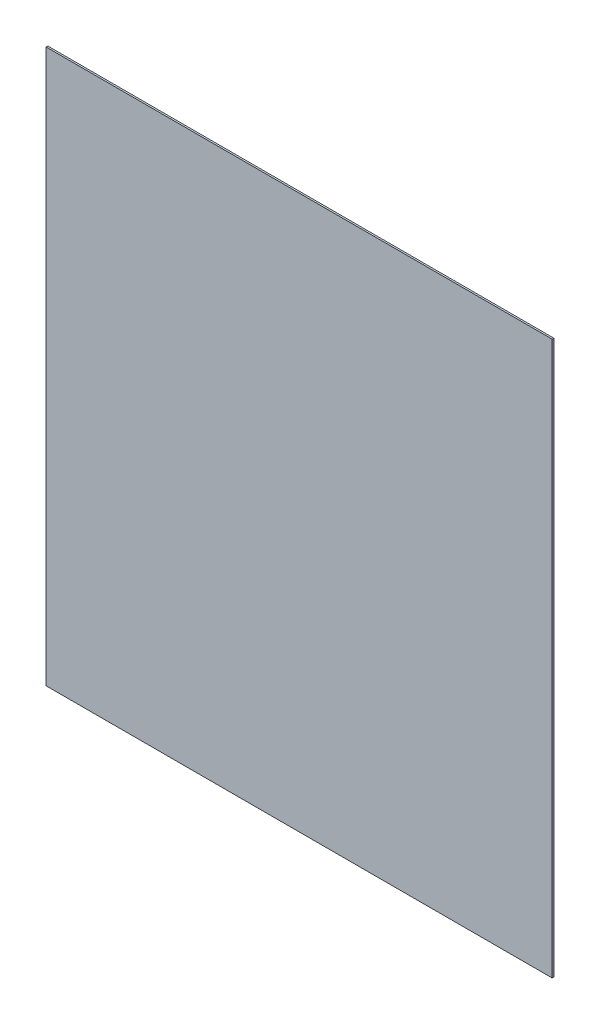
ISO-10303-21;
HEADER;
FILE_DESCRIPTION(('STEP AP214'),'2;1');
FILE_NAME('part.step','',(''),(''),'','','');
FILE_SCHEMA(('AUTOMOTIVE_DESIGN { 1 0 10303 214 1 1 1 1 }'));
ENDSEC;
DATA;
#1=APPLICATION_CONTEXT('core data for automotive mechanical design processes');
#2=APPLICATION_PROTOCOL_DEFINITION('international standard','automotive_design',2000,#1);
#3=PRODUCT_CONTEXT('',#1,'mechanical');
#4=PRODUCT('Part','Part','',(#3));
#5=PRODUCT_RELATED_PRODUCT_CATEGORY('part','',(#4));
#6=PRODUCT_DEFINITION_FORMATION('','',#4);
#7=PRODUCT_DEFINITION_CONTEXT('part definition',#1,'design');
#8=PRODUCT_DEFINITION('design','',#6,#7);
#9=PRODUCT_DEFINITION_SHAPE('','',#8);
#10=(LENGTH_UNIT() NAMED_UNIT(*) SI_UNIT(.MILLI.,.METRE.));
#11=(NAMED_UNIT(*) PLANE_ANGLE_UNIT() SI_UNIT($,.RADIAN.));
#12=(NAMED_UNIT(*) SI_UNIT($,.STERADIAN.) SOLID_ANGLE_UNIT());
#13=UNCERTAINTY_MEASURE_WITH_UNIT(LENGTH_MEASURE(1.E-05),#10,'distance_accuracy_value','');
#14=(GEOMETRIC_REPRESENTATION_CONTEXT(3) GLOBAL_UNCERTAINTY_ASSIGNED_CONTEXT((#13)) GLOBAL_UNIT_ASSIGNED_CONTEXT((#10,
#11,#12)) REPRESENTATION_CONTEXT('',''));
#15=CARTESIAN_POINT('',(0.,0.,0.));
#16=DIRECTION('',(0.,0.,1.));
#17=DIRECTION('',(1.,0.,0.));
#18=AXIS2_PLACEMENT_3D('',#15,#16,#17);
#19=CARTESIAN_POINT('',(0.,0.,2.));
#20=DIRECTION('',(0.,0.,1.));
#21=DIRECTION('',(1.,0.,0.));
#22=AXIS2_PLACEMENT_3D('',#19,#20,#21);
#23=PLANE('',#22);
#24=DIRECTION('',(1.,0.,0.));
#25=VECTOR('',#24,1.);
#26=CARTESIAN_POINT('',(-295.,-322.5,2.));
#27=LINE('',#26,#25);
#28=CARTESIAN_POINT('',(-295.,-322.5,2.));
#29=VERTEX_POINT('',#28);
#30=CARTESIAN_POINT('',(295.,-322.5,2.));
#31=VERTEX_POINT('',#30);
#32=EDGE_CURVE('E81',#29,#31,#27,.T.);
#33=ORIENTED_EDGE('',*,*,#32,.T.);
#34=DIRECTION('',(0.,1.,0.));
#35=VECTOR('',#34,1.);
#36=CARTESIAN_POINT('',(295.,-322.5,2.));
#37=LINE('',#36,#35);
#38=CARTESIAN_POINT('',(295.,322.5,2.));
#39=VERTEX_POINT('',#38);
#40=EDGE_CURVE('E96',#31,#39,#37,.T.);
#41=ORIENTED_EDGE('',*,*,#40,.T.);
#42=DIRECTION('',(-1.,0.,0.));
#43=VECTOR('',#42,1.);
#44=CARTESIAN_POINT('',(295.,322.5,2.));
#45=LINE('',#44,#43);
#46=CARTESIAN_POINT('',(-295.,322.5,2.));
#47=VERTEX_POINT('',#46);
#48=EDGE_CURVE('E74',#39,#47,#45,.T.);
#49=ORIENTED_EDGE('',*,*,#48,.T.);
#50=DIRECTION('',(0.,-1.,0.));
#51=VECTOR('',#50,1.);
#52=CARTESIAN_POINT('',(-295.,322.5,2.));
#53=LINE('',#52,#51);
#54=EDGE_CURVE('E10',#47,#29,#53,.T.);
#55=ORIENTED_EDGE('',*,*,#54,.T.);
#56=EDGE_LOOP('',(#33,#41,#49,#55));
#57=FACE_BOUND('',#56,.T.);
#58=ADVANCED_FACE('F16',(#57),#23,.T.);
#59=CARTESIAN_POINT('',(0.,0.,0.));
#60=DIRECTION('',(0.,0.,1.));
#61=DIRECTION('',(1.,0.,0.));
#62=AXIS2_PLACEMENT_3D('',#59,#60,#61);
#63=PLANE('',#62);
#64=DIRECTION('',(0.,-1.,0.));
#65=VECTOR('',#64,1.);
#66=CARTESIAN_POINT('',(-295.,322.5,0.));
#67=LINE('',#66,#65);
#68=CARTESIAN_POINT('',(-295.,322.5,0.));
#69=VERTEX_POINT('',#68);
#70=CARTESIAN_POINT('',(-295.,-322.5,0.));
#71=VERTEX_POINT('',#70);
#72=EDGE_CURVE('E25',#69,#71,#67,.T.);
#73=ORIENTED_EDGE('',*,*,#72,.F.);
#74=DIRECTION('',(-1.,0.,0.));
#75=VECTOR('',#74,1.);
#76=CARTESIAN_POINT('',(295.,322.5,0.));
#77=LINE('',#76,#75);
#78=CARTESIAN_POINT('',(295.,322.5,0.));
#79=VERTEX_POINT('',#78);
#80=EDGE_CURVE('E95',#79,#69,#77,.T.);
#81=ORIENTED_EDGE('',*,*,#80,.F.);
#82=DIRECTION('',(0.,1.,0.));
#83=VECTOR('',#82,1.);
#84=CARTESIAN_POINT('',(295.,-322.5,0.));
#85=LINE('',#84,#83);
#86=CARTESIAN_POINT('',(295.,-322.5,0.));
#87=VERTEX_POINT('',#86);
#88=EDGE_CURVE('E83',#87,#79,#85,.T.);
#89=ORIENTED_EDGE('',*,*,#88,.F.);
#90=DIRECTION('',(1.,0.,0.));
#91=VECTOR('',#90,1.);
#92=CARTESIAN_POINT('',(-295.,-322.5,0.));
#93=LINE('',#92,#91);
#94=EDGE_CURVE('E79',#71,#87,#93,.T.);
#95=ORIENTED_EDGE('',*,*,#94,.F.);
#96=EDGE_LOOP('',(#73,#81,#89,#95));
#97=FACE_BOUND('',#96,.T.);
#98=ADVANCED_FACE('F18',(#97),#63,.F.);
#99=CARTESIAN_POINT('',(-295.,322.5,0.));
#100=DIRECTION('',(1.,0.,0.));
#101=DIRECTION('',(0.,1.,0.));
#102=AXIS2_PLACEMENT_3D('',#99,#100,#101);
#103=PLANE('',#102);
#104=ORIENTED_EDGE('',*,*,#72,.T.);
#105=DIRECTION('',(0.,0.,1.));
#106=VECTOR('',#105,1.);
#107=CARTESIAN_POINT('',(-295.,-322.5,0.));
#108=LINE('',#107,#106);
#109=EDGE_CURVE('E68',#71,#29,#108,.T.);
#110=ORIENTED_EDGE('',*,*,#109,.T.);
#111=ORIENTED_EDGE('',*,*,#54,.F.);
#112=DIRECTION('',(0.,0.,1.));
#113=VECTOR('',#112,1.);
#114=CARTESIAN_POINT('',(-295.,322.5,0.));
#115=LINE('',#114,#113);
#116=EDGE_CURVE('E71',#69,#47,#115,.T.);
#117=ORIENTED_EDGE('',*,*,#116,.F.);
#118=EDGE_LOOP('',(#104,#110,#111,#117));
#119=FACE_BOUND('',#118,.T.);
#120=ADVANCED_FACE('F67',(#119),#103,.F.);
#121=CARTESIAN_POINT('',(295.,322.5,0.));
#122=DIRECTION('',(0.,-1.,0.));
#123=DIRECTION('',(0.,0.,-1.));
#124=AXIS2_PLACEMENT_3D('',#121,#122,#123);
#125=PLANE('',#124);
#126=ORIENTED_EDGE('',*,*,#80,.T.);
#127=ORIENTED_EDGE('',*,*,#116,.T.);
#128=ORIENTED_EDGE('',*,*,#48,.F.);
#129=DIRECTION('',(0.,0.,1.));
#130=VECTOR('',#129,1.);
#131=CARTESIAN_POINT('',(295.,322.5,0.));
#132=LINE('',#131,#130);
#133=EDGE_CURVE('E102',#79,#39,#132,.T.);
#134=ORIENTED_EDGE('',*,*,#133,.F.);
#135=EDGE_LOOP('',(#126,#127,#128,#134));
#136=FACE_BOUND('',#135,.T.);
#137=ADVANCED_FACE('F116',(#136),#125,.F.);
#138=CARTESIAN_POINT('',(295.,-322.5,0.));
#139=DIRECTION('',(-1.,0.,0.));
#140=DIRECTION('',(0.,0.,1.));
#141=AXIS2_PLACEMENT_3D('',#138,#139,#140);
#142=PLANE('',#141);
#143=ORIENTED_EDGE('',*,*,#88,.T.);
#144=ORIENTED_EDGE('',*,*,#133,.T.);
#145=ORIENTED_EDGE('',*,*,#40,.F.);
#146=DIRECTION('',(0.,0.,1.));
#147=VECTOR('',#146,1.);
#148=CARTESIAN_POINT('',(295.,-322.5,0.));
#149=LINE('',#148,#147);
#150=EDGE_CURVE('E88',#87,#31,#149,.T.);
#151=ORIENTED_EDGE('',*,*,#150,.F.);
#152=EDGE_LOOP('',(#143,#144,#145,#151));
#153=FACE_BOUND('',#152,.T.);
#154=ADVANCED_FACE('F118',(#153),#142,.F.);
#155=CARTESIAN_POINT('',(-295.,-322.5,0.));
#156=DIRECTION('',(0.,1.,0.));
#157=DIRECTION('',(1.,0.,0.));
#158=AXIS2_PLACEMENT_3D('',#155,#156,#157);
#159=PLANE('',#158);
#160=ORIENTED_EDGE('',*,*,#94,.T.);
#161=ORIENTED_EDGE('',*,*,#150,.T.);
#162=ORIENTED_EDGE('',*,*,#32,.F.);
#163=ORIENTED_EDGE('',*,*,#109,.F.);
#164=EDGE_LOOP('',(#160,#161,#162,#163));
#165=FACE_BOUND('',#164,.T.);
#166=ADVANCED_FACE('F77',(#165),#159,.F.);
#167=CLOSED_SHELL('',(#58,#98,#120,#137,#154,#166));
#168=MANIFOLD_SOLID_BREP('B1',#167);
#169=ADVANCED_BREP_SHAPE_REPRESENTATION('',(#18,#168),#14);
#170=SHAPE_DEFINITION_REPRESENTATION(#9,#169);
ENDSEC;
END-ISO-10303-21;
